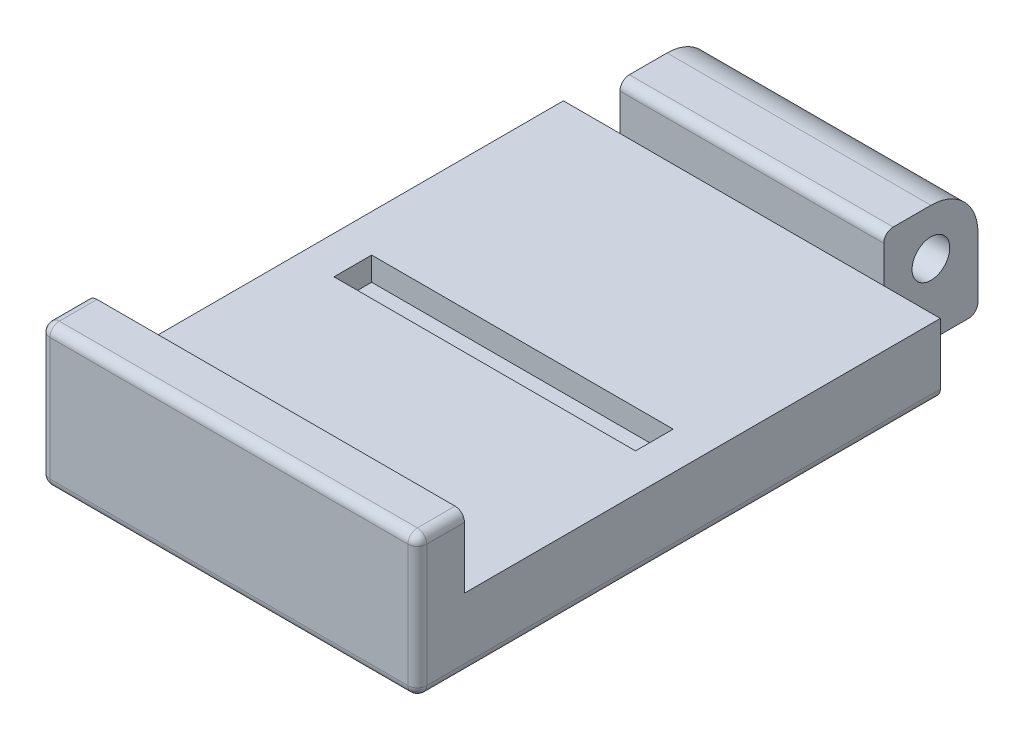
from build123d import *
from OCP.BRepFilletAPI import BRepFilletAPI_MakeFillet

# Parameters (mm, degrees)
CROQUIS2_W                 = 40
CROQUIS2_H                 = 15
SALIENTE_EXTRUIR1_DEPTH    = 65.5
REDONDEO1_R                = 1
CORTAR_EXTRUIR1_DEPTH      = 40
CORTAR_EXTRUIR4_DEPTH      = 1
CORTAR_EXTRUIR4_DEPTH_BACK = 10
CROQUIS9_W                 = 6
CROQUIS9_H                 = 15
CROQUIS10_W                = 6
CROQUIS10_H                = 15
CORTAR_EXTRUIR5_DEPTH      = 10
CROQUIS7_R                 = 2
CORTAR_EXTRUIR6_DEPTH      = 40
CROQUIS14_W                = 40.000001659
CROQUIS14_H                = 60.5
CORTAR_EXTRUIR9_DEPTH      = 2.6
REDONDEO5_R1               = 5
REDONDEO5_R2               = 1
CROQUIS16_W                = 32
CROQUIS16_H                = 4
CORTAR_EXTRUIR10_DEPTH     = 2.5


with BuildPart() as part:
    # Croquis2 → Saliente-Extruir1 (new body)
    with BuildSketch(Plane.XY):
        Rectangle(CROQUIS2_W, CROQUIS2_H)
    extrude(amount=SALIENTE_EXTRUIR1_DEPTH)

    # Redondeo1
    redondeo1_edges = [part.edges().sort_by_distance(p)[0] for p in [
        (-20, 0, 65.5),
        (0, -7.5, 65.5),
        (20, 0, 65.5),
        (0, -7.5, 0),
        (-20, 0, 0),
        (0, 7.5, 0),
        (20, 0, 0),
        (0, 7.5, 65.5),
        (20, -7.5, 32.75),
        (-20, -7.5, 32.75),
        (-20, 7.5, 32.75),
        (20, 7.5, 32.75),
    ]]
    fillet(redondeo1_edges, radius=REDONDEO1_R)

    # Croquis6 → Cortar-Extruir1 (cut)
    with BuildSketch(Plane(origin=(20, 0, 0), x_dir=(0, 0, -1), z_dir=(1, 0, 0))):
        Polygon((-60.5, 7.5), (-60.5, 0), (-55.501553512, 0), (-10, 0), (-10, 5), (-10, 7.5), align=None)
    extrude(amount=-CORTAR_EXTRUIR1_DEPTH, mode=Mode.SUBTRACT)

    # Croquis9 → Cortar-Extruir4 (cut, two sides: drawn at the far end of the back side and taken through both)
    with BuildSketch(Plane(origin=(0, 0, 0), x_dir=(-1, 0, 0), z_dir=(0, 0, -1)).offset(-CORTAR_EXTRUIR4_DEPTH_BACK)):
        with Locations((-17, 0)):
            Rectangle(CROQUIS9_W, CROQUIS9_H)
    extrude(amount=CORTAR_EXTRUIR4_DEPTH + CORTAR_EXTRUIR4_DEPTH_BACK, mode=Mode.SUBTRACT)

    # Croquis10 → Cortar-Extruir5 (cut)
    with BuildSketch(Plane(origin=(0, 0, 0), x_dir=(-1, 0, 0), z_dir=(0, 0, -1))):
        with Locations((17, 0)):
            Rectangle(CROQUIS10_W, CROQUIS10_H)
    extrude(amount=-CORTAR_EXTRUIR5_DEPTH, mode=Mode.SUBTRACT)

    # Croquis7 → Cortar-Extruir6 (cut)
    with BuildSketch(Plane(origin=(20, 0, 0), x_dir=(0, 0, -1), z_dir=(1, 0, 0))):
        with Locations((-5, 0)):
            Circle(CROQUIS7_R)
    extrude(amount=-CORTAR_EXTRUIR6_DEPTH, mode=Mode.SUBTRACT)

    # Croquis14 → Cortar-Extruir9 (cut)
    with BuildSketch(Plane(origin=(0, 7.5, 0), x_dir=(1, 0, 0), z_dir=(0, 1, 0))):
        with Locations((8.3e-07, -30.25)):
            Rectangle(CROQUIS14_W, CROQUIS14_H)
    extrude(amount=-CORTAR_EXTRUIR9_DEPTH, mode=Mode.SUBTRACT)

    # Redondeo5: one fillet with a radius per group of edges: ONE call of the kernel's fillet builder (fillet() takes one radius for all edges)
    redondeo5_edges_1 = [part.edges().sort_by_distance(p)[0] for p in [
        (0, 4.9, 0),
    ]]
    redondeo5_edges_2 = [part.edges().sort_by_distance(p)[0] for p in [
        (0, 4.9, 10),
    ]]
    redondeo5 = BRepFilletAPI_MakeFillet(part.part.solid().wrapped)
    for e in redondeo5_edges_1:
        redondeo5.Add(REDONDEO5_R1, e.wrapped)
    for e in redondeo5_edges_2:
        redondeo5.Add(REDONDEO5_R2, e.wrapped)
    add(Compound.cast(redondeo5.Shape()), mode=Mode.REPLACE)

    # Croquis16 → Cortar-Extruir10 (cut)
    with BuildSketch(Plane(origin=(0, 0, 0), x_dir=(1, 0, 0), z_dir=(0, 1, 0))):
        with Locations((0, -36.35)):
            Rectangle(CROQUIS16_W, CROQUIS16_H)
    extrude(amount=-CORTAR_EXTRUIR10_DEPTH, mode=Mode.SUBTRACT)


solid = part.part
